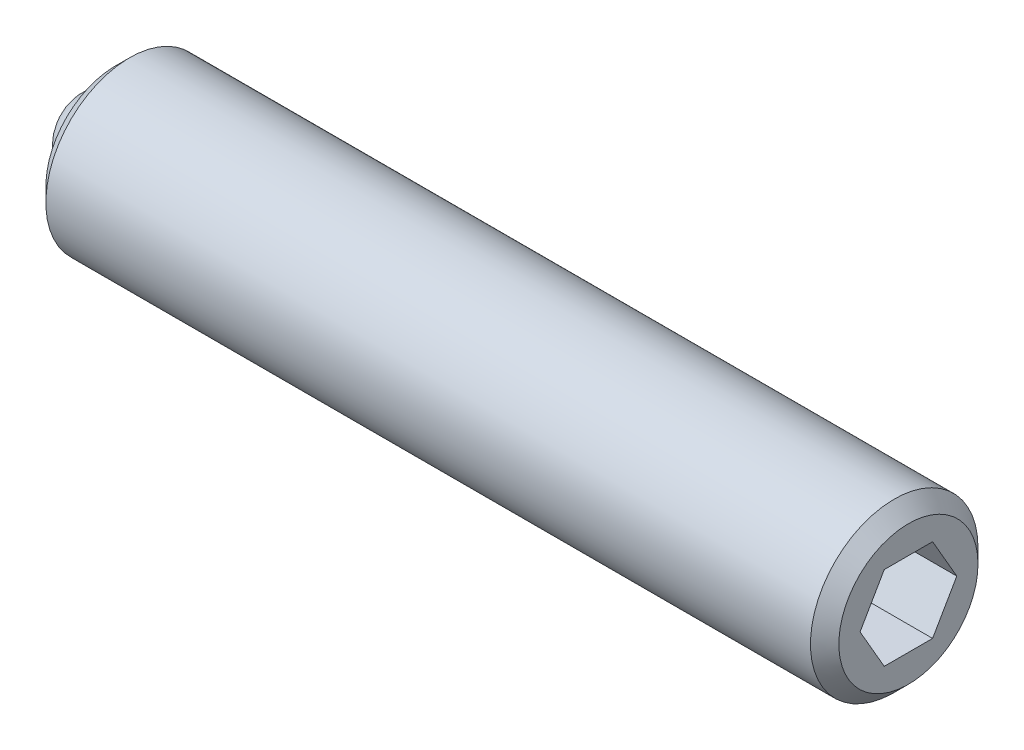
from build123d import *

# Parameters (mm, degrees)
SKETCH2_R           = 1.5
BOSS_EXTRUDE1_DEPTH = 14.2
CHAMFER1_SIZE       = 0.254
CHAMFER2_SIZE       = 0.254
CUT_EXTRUDE2_DEPTH  = 2
SKETCH3_R           = 0.8
CUT_EXTRUDE3_DEPTH  = 0.8
CUT_EXTRUDE4_DEPTH  = 0.8


with BuildPart() as part:
    # Sketch2 → Boss-Extrude1 (new body)
    with BuildSketch(Plane(origin=(0, 0, 0), x_dir=(0, 0, -1), z_dir=(1, 0, 0))):
        Circle(SKETCH2_R)
    extrude(amount=BOSS_EXTRUDE1_DEPTH)

    # Chamfer1
    chamfer1_edges = [part.edges().sort_by_distance(p)[0] for p in [
        (0, 0, 1.5),
    ]]
    chamfer(chamfer1_edges, length=CHAMFER1_SIZE)

    # Chamfer2
    chamfer2_edges = [part.edges().sort_by_distance(p)[0] for p in [
        (14.2, 0, 1.5),
    ]]
    chamfer(chamfer2_edges, length=CHAMFER2_SIZE)

    # Sketch4 → Cut-Extrude2 (cut)
    with BuildSketch(Plane(origin=(14.2, 0, 0), x_dir=(0, 0, -1), z_dir=(1, 0, 0))):
        Polygon((0.866025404, 0), (0.433012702, 0.75), (-0.433012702, 0.75), (-0.866025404, 0), (-0.433012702, -0.75), (0.433012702, -0.75), align=None)
    extrude(amount=-CUT_EXTRUDE2_DEPTH, mode=Mode.SUBTRACT)

    # Sketch3 → Cut-Extrude3 (cut)
    with BuildSketch(Plane.ZY):
        Circle(SKETCH3_R)
    extrude(amount=-CUT_EXTRUDE3_DEPTH, mode=Mode.SUBTRACT)

    # Sketch7 → Cut-Extrude4 (cut)
    with BuildSketch(Plane.ZY):
        with BuildLine():
            ThreePointArc((0.063449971, 0.797479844), (0, 0.8), (-0.063449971, 0.797479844))
            ThreePointArc((-0.063449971, 0.797479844), (0, 0.8635), (0.063449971, 0.797479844))
        make_face()
    extrude(amount=-CUT_EXTRUDE4_DEPTH, mode=Mode.SUBTRACT)


with BuildPart() as body_2:
    # Sketch5 → Revolve1 (revolve)
    with BuildSketch(Plane.ZY):
        with BuildLine():
            Line((0, 0), (0, -0.8))
            ThreePointArc((0, -0.8), (-0.8, 0), (0, 0.8))
            Line((0, 0.8), (0, 0))
        make_face()
    revolve(axis=Axis((0, 0, 0), (0, 1, 0)))


solid = Compound([part.part, body_2.part])
